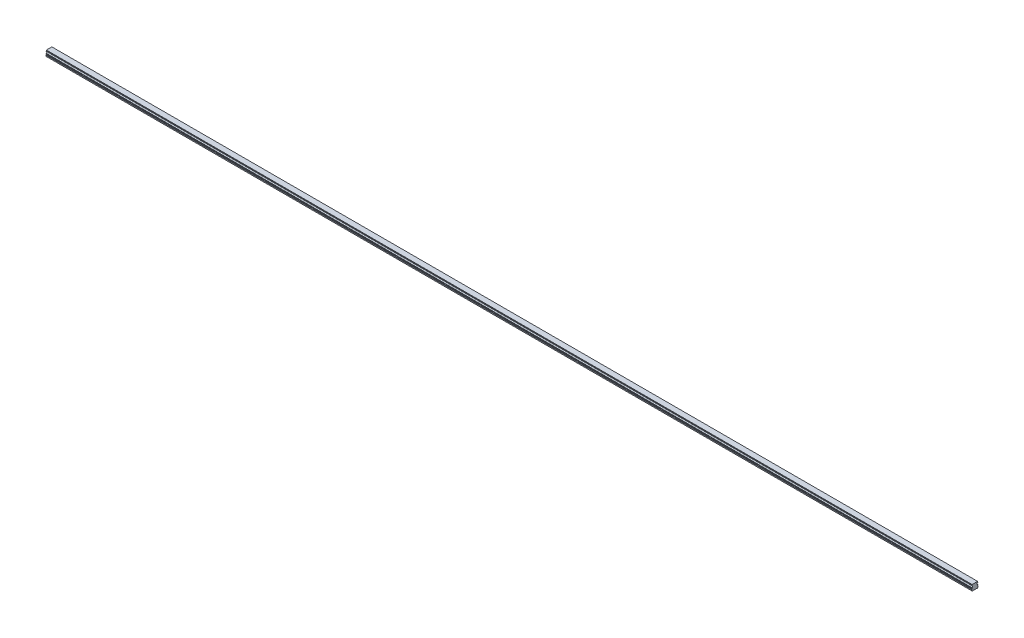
from build123d import *

# Parameters (mm, degrees)
BOSS_EXTRUDE1_DEPTH        = 2220
SKETCH3_R                  = 2.5
SKETCH3_R_2                = 2.1
CUT_EXTRUDE3_DEPTH         = 7
SKETCH3_2_R                = 2.1
CUT_EXTRUDE4_DEPTH         = 9.5
CHAMFER1_SIZE              = 0.4
LPATTERN2_COUNT            = 37
LPATTERN2_PITCH            = 60
CHAMFER1_OF_LPATTERN2_SIZE = 0.4


with BuildPart() as part:
    # Sketch1 → Boss-Extrude1 (new body)
    with BuildSketch(Plane(origin=(0, 0, 0), x_dir=(0, 0, -1), z_dir=(1, 0, 0))):
        with BuildLine():
            Line((6.59, 14), (-6.59, 14))
            Line((-6.59, 14), (-6.59, 13.15))
            Line((-6.59, 13.15), (-6.96, 12.356532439))
            Line((-6.96, 12.356532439), (-6.96, 11.435174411))
            ThreePointArc((-6.96, 11.435174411), (-5.25, 9.5), (-6.96, 7.564825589))
            Line((-6.96, 7.564825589), (-6.96, 6.643467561))
            Line((-6.96, 6.643467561), (-6.59, 5.85))
            Line((-6.59, 5.85), (-7.032116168, 4.2))
            Line((-7.032116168, 4.2), (-7.5, 3.929867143))
            Line((-7.5, 3.929867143), (-7.5, 1.4))
            Line((-7.5, 1.4), (-6.1, 0))
            Line((-6.1, 0), (-3.65, 0))
            Line((-3.65, 0), (-3.25, 0.4))
            Line((-3.25, 0.4), (3.25, 0.4))
            Line((3.25, 0.4), (3.65, 0))
            Line((3.65, 0), (6.1, 0))
            Line((6.1, 0), (7.5, 1.4))
            Line((7.5, 1.4), (7.5, 3.929867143))
            Line((7.5, 3.929867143), (7.032116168, 4.2))
            Line((7.032116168, 4.2), (6.59, 5.85))
            Line((6.59, 5.85), (6.96, 6.643467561))
            Line((6.96, 6.643467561), (6.96, 7.564825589))
            ThreePointArc((6.96, 7.564825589), (5.25, 9.5), (6.96, 11.435174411))
            Line((6.96, 11.435174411), (6.96, 12.356532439))
            Line((6.96, 12.356532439), (6.59, 13.15))
            Line((6.59, 13.15), (6.59, 14))
        make_face()
    extrude(amount=BOSS_EXTRUDE1_DEPTH)

    # Sketch3 → Cut-Extrude3 (cut)
    with BuildSketch(Plane.XZ):
        with Locations(Location((30, 0, 0), (0, 0, 270))):
            Circle(SKETCH3_R)
        with Locations(Location((30, 0, 0), (0, 0, 270))):
            Circle(SKETCH3_R_2, mode=Mode.SUBTRACT)
    cut_extrude3 = extrude(amount=-CUT_EXTRUDE3_DEPTH, mode=Mode.SUBTRACT)

    # Sketch3_2 → Cut-Extrude4 (cut)
    with BuildSketch(Plane.XZ):
        with Locations(Location((30, 0, 0), (0, 0, 270))):
            Circle(SKETCH3_2_R)
    cut_extrude4 = extrude(amount=-CUT_EXTRUDE4_DEPTH, mode=Mode.SUBTRACT)

    # Cut-Extrude5 cone 1 section (on through the dimple's axis) → Cut-Extrude5 (revolve, cut)
    with BuildSketch(Plane(origin=(30, 9.5, 0), x_dir=(0, 0, -1), z_dir=(1, 0, 0))):
        Polygon((0, 0), (2.1, 0), (0, 1.212435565), align=None)
    revolve(axis=Axis((30, 9.5, 0), (0, 1, 0)), mode=Mode.SUBTRACT)

    # Chamfer1
    chamfer1_edges = [part.edges().sort_by_distance(p)[0] for p in [
        (30, 0.4, 2.5),
    ]]
    chamfer(chamfer1_edges, length=CHAMFER1_SIZE)

    # LPattern2: Cut-Extrude3, Cut-Extrude4 ×37
    with Locations(*[(i * LPATTERN2_PITCH, 0, 0) for i in range(1, LPATTERN2_COUNT)]):
        add(cut_extrude3, mode=Mode.SUBTRACT)
        add(cut_extrude4, mode=Mode.SUBTRACT)

    # Chamfer1 of LPattern2
    chamfer1_of_lpattern2_edges = [part.edges().sort_by_distance(p)[0] for p in [
        (90, 0.4, 2.5),
        (150, 0.4, 2.5),
        (210, 0.4, 2.5),
        (270, 0.4, 2.5),
        (330, 0.4, 2.5),
        (390, 0.4, 2.5),
        (450, 0.4, 2.5),
        (510, 0.4, 2.5),
        (570, 0.4, 2.5),
        (630, 0.4, 2.5),
        (690, 0.4, 2.5),
        (750, 0.4, 2.5),
        (810, 0.4, 2.5),
        (870, 0.4, 2.5),
        (930, 0.4, 2.5),
        (990, 0.4, 2.5),
        (1050, 0.4, 2.5),
        (1110, 0.4, 2.5),
        (1170, 0.4, 2.5),
        (1230, 0.4, 2.5),
        (1290, 0.4, 2.5),
        (1350, 0.4, 2.5),
        (1410, 0.4, 2.5),
        (1470, 0.4, 2.5),
        (1530, 0.4, 2.5),
        (1590, 0.4, 2.5),
        (1650, 0.4, 2.5),
        (1710, 0.4, 2.5),
        (1770, 0.4, 2.5),
        (1830, 0.4, 2.5),
        (1890, 0.4, 2.5),
        (1950, 0.4, 2.5),
        (2010, 0.4, 2.5),
        (2070, 0.4, 2.5),
        (2130, 0.4, 2.5),
        (2190, 0.4, 2.5),
    ]]
    chamfer(chamfer1_of_lpattern2_edges, length=CHAMFER1_OF_LPATTERN2_SIZE)


solid = part.part
